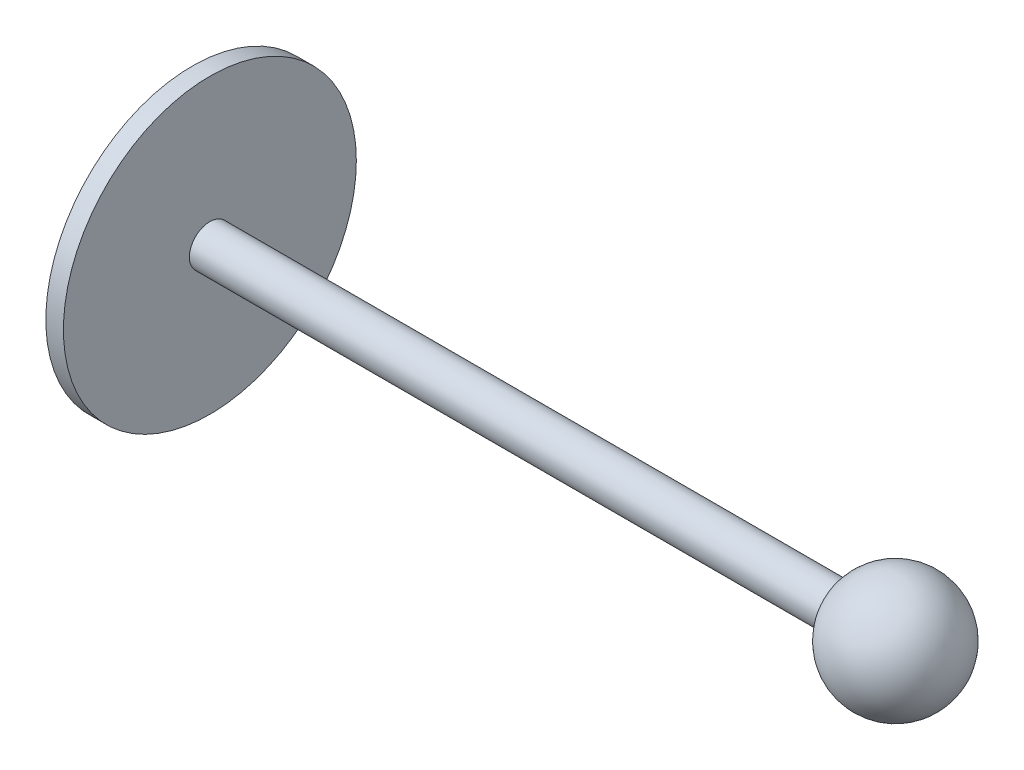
from build123d import *


with BuildPart() as part:
    # Esquisse1 → R_volution1 (revolve)
    with BuildSketch(Plane.XY, mode=Mode.PRIVATE) as r_volution1_sk:
        with BuildLine():
            Line((-9.367496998, 3.5), (-117, 3.5))
            Line((-117, 3.5), (-117, 25))
            Line((-117, 25), (-120, 25))
            Line((-120, 25), (-120, 0))
            Line((-120, 0), (10, 0))
            ThreePointArc((10, 0), (1.778346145, 9.840603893), (-9.367496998, 3.5))
        make_face()
    revolve(r_volution1_sk.sketch.rotate(Axis((38.738434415, 0, 0), (-1, 0, 0)), 90), axis=Axis((38.738434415, 0, 0), (-1, 0, 0)))


solid = part.part
